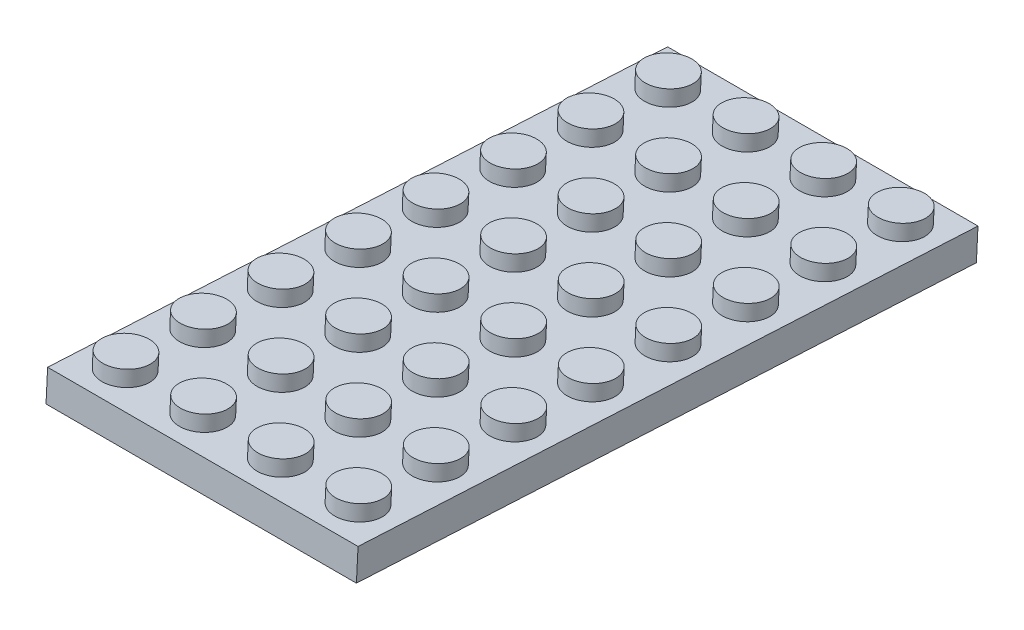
from build123d import *

# Parameters (mm, degrees)
SKETCH2_W             = 32
SKETCH2_H             = 64
BOSS_EXTRUDE1_DEPTH   = 3.2
SKETCH3_R             = 2.4
BOSS_EXTRUDE2_DEPTH   = 1.6
LPATTERN1_COUNT       = 4
LPATTERN1_PITCH       = 8
LPATTERN1_COUNT_DIR2  = 8
LPATTERN1_PITCH_DIR2  = 8
SHELL1_T              = -1.6
SKETCH4_R             = 3.25
BOSS_EXTRUDE3_DEPTH   = 1.6
SKETCH5_R             = 2.4
CUT_EXTRUDE1_DEPTH    = 1.6
LPATTERN2_COUNT       = 7
LPATTERN2_PITCH       = 8
LPATTERN2_COUNT_DIR2  = 3
LPATTERN2_PITCH_DIR2  = 8
BODY_MOVE_COPY1_ANGLE = 87


with BuildPart() as part:
    # Sketch2 → Boss-Extrude1 (new body)
    with BuildSketch(Plane.XY):
        Rectangle(SKETCH2_W, SKETCH2_H)
    extrude(amount=BOSS_EXTRUDE1_DEPTH)

    # Sketch3 → Boss-Extrude2 (add)
    with BuildSketch(Plane(origin=(0, 0, 0), x_dir=(-1, 0, 0), z_dir=(0, 0, -1))):
        with Locations((-12, 28)):
            Circle(SKETCH3_R)
    boss_extrude2 = extrude(amount=BOSS_EXTRUDE2_DEPTH)

    # LPattern1: Boss-Extrude2 4 × 8
    with Locations(*[(-i * LPATTERN1_PITCH, -j * LPATTERN1_PITCH_DIR2, 0) for i in range(LPATTERN1_COUNT) for j in range(LPATTERN1_COUNT_DIR2) if (i, j) != (0, 0)]):
        add(boss_extrude2)

    # Shell1
    shell1_openings = [part.faces().sort_by_distance(p)[0] for p in [
        (0, 0, 3.2),
    ]]
    offset(amount=SHELL1_T, openings=shell1_openings, kind=Kind.INTERSECTION)

    # Sketch4 → Boss-Extrude3 (add)
    with BuildSketch(Plane.XY.offset(1.6)):
        with Locations(Location((-8.004968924, 24, 0), (0, 0, 180))):
            Circle(SKETCH4_R)
    boss_extrude3 = extrude(amount=BOSS_EXTRUDE3_DEPTH)

    # Sketch5 → Cut-Extrude1 (cut)
    with BuildSketch(Plane.XY.offset(3.2)):
        with Locations((-8, 24)):
            Circle(SKETCH5_R)
    cut_extrude1 = extrude(amount=-CUT_EXTRUDE1_DEPTH, mode=Mode.SUBTRACT)

    # LPattern2: Boss-Extrude3, Cut-Extrude1 7 × 3
    with Locations(*[(j * LPATTERN2_PITCH_DIR2, -i * LPATTERN2_PITCH, 0) for i in range(LPATTERN2_COUNT) for j in range(LPATTERN2_COUNT_DIR2) if (i, j) != (0, 0)]):
        add(boss_extrude3)
        add(cut_extrude1, mode=Mode.SUBTRACT)


with BuildPart() as part_1:
    # Body-Move_Copy1: moved
    add(part.part.rotate(Axis((0, 0, 0.8), (1, 0, 0)), BODY_MOVE_COPY1_ANGLE))


solid = part_1.part
